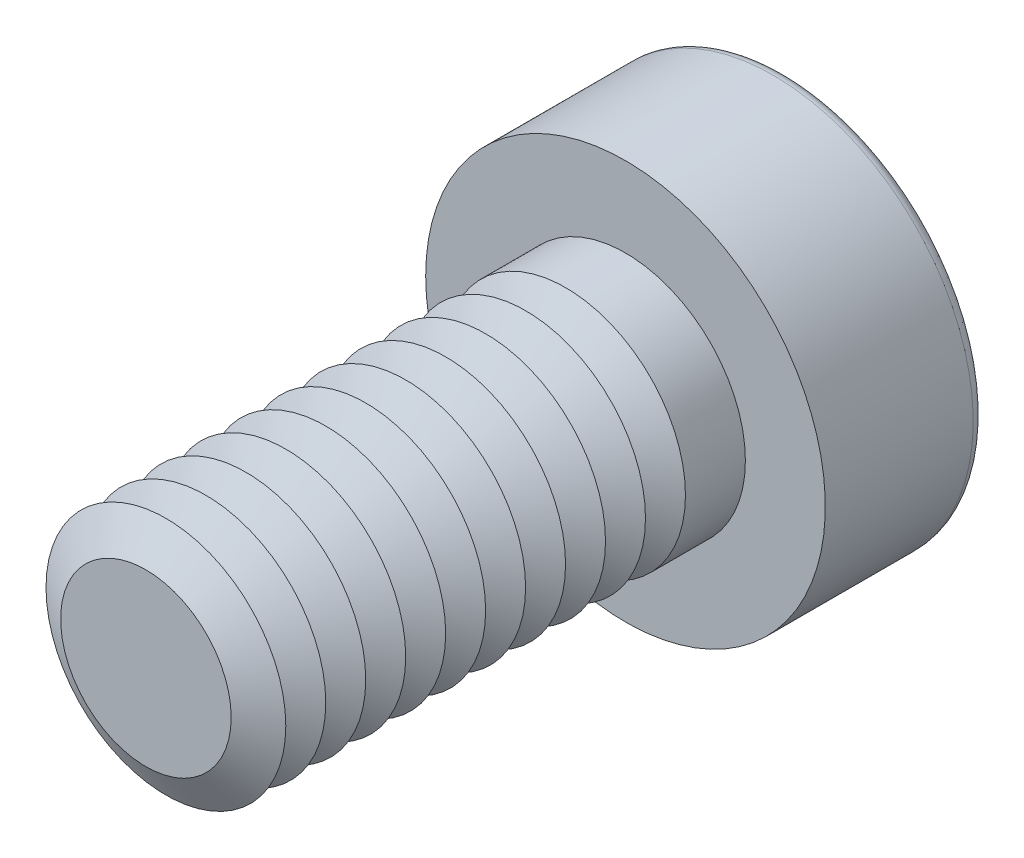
ISO-10303-21;
HEADER;
FILE_DESCRIPTION(('STEP AP214'),'2;1');
FILE_NAME('part.step','',(''),(''),'','','');
FILE_SCHEMA(('AUTOMOTIVE_DESIGN { 1 0 10303 214 1 1 1 1 }'));
ENDSEC;
DATA;
#1=APPLICATION_CONTEXT('core data for automotive mechanical design processes');
#2=APPLICATION_PROTOCOL_DEFINITION('international standard','automotive_design',2000,#1);
#3=PRODUCT_CONTEXT('',#1,'mechanical');
#4=PRODUCT('Part','Part','',(#3));
#5=PRODUCT_RELATED_PRODUCT_CATEGORY('part','',(#4));
#6=PRODUCT_DEFINITION_FORMATION('','',#4);
#7=PRODUCT_DEFINITION_CONTEXT('part definition',#1,'design');
#8=PRODUCT_DEFINITION('design','',#6,#7);
#9=PRODUCT_DEFINITION_SHAPE('','',#8);
#10=(LENGTH_UNIT() NAMED_UNIT(*) SI_UNIT(.MILLI.,.METRE.));
#11=(NAMED_UNIT(*) PLANE_ANGLE_UNIT() SI_UNIT($,.RADIAN.));
#12=(NAMED_UNIT(*) SI_UNIT($,.STERADIAN.) SOLID_ANGLE_UNIT());
#13=UNCERTAINTY_MEASURE_WITH_UNIT(LENGTH_MEASURE(1.E-05),#10,'distance_accuracy_value','');
#14=(GEOMETRIC_REPRESENTATION_CONTEXT(3) GLOBAL_UNCERTAINTY_ASSIGNED_CONTEXT((#13)) GLOBAL_UNIT_ASSIGNED_CONTEXT((#10,
#11,#12)) REPRESENTATION_CONTEXT('',''));
#15=CARTESIAN_POINT('',(0.,0.,0.));
#16=DIRECTION('',(0.,0.,1.));
#17=DIRECTION('',(1.,0.,0.));
#18=AXIS2_PLACEMENT_3D('',#15,#16,#17);
#19=CARTESIAN_POINT('',(0.,0.,8.5));
#20=DIRECTION('',(0.,0.,1.));
#21=DIRECTION('',(1.,0.,0.));
#22=AXIS2_PLACEMENT_3D('',#19,#20,#21);
#23=CONICAL_SURFACE('',#22,3.,1.0471975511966);
#24=CARTESIAN_POINT('',(0.,0.,8.));
#25=DIRECTION('',(0.,0.,1.));
#26=DIRECTION('',(1.,0.,0.));
#27=AXIS2_PLACEMENT_3D('',#24,#25,#26);
#28=CIRCLE('',#27,2.13397459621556);
#29=CARTESIAN_POINT('',(2.13397459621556,0.,8.));
#30=VERTEX_POINT('',#29);
#31=EDGE_CURVE('E313',#30,#30,#28,.T.);
#32=ORIENTED_EDGE('',*,*,#31,.T.);
#33=EDGE_LOOP('',(#32));
#34=FACE_BOUND('',#33,.T.);
#35=CARTESIAN_POINT('',(0.,0.,8.5));
#36=DIRECTION('',(0.,0.,1.));
#37=DIRECTION('',(1.,0.,0.));
#38=AXIS2_PLACEMENT_3D('',#35,#36,#37);
#39=CIRCLE('',#38,3.);
#40=CARTESIAN_POINT('',(3.,0.,8.5));
#41=VERTEX_POINT('',#40);
#42=EDGE_CURVE('E316',#41,#41,#39,.T.);
#43=ORIENTED_EDGE('',*,*,#42,.F.);
#44=EDGE_LOOP('',(#43));
#45=FACE_BOUND('',#44,.T.);
#46=ADVANCED_FACE('F39',(#34,#45),#23,.T.);
#47=CARTESIAN_POINT('',(0.,0.,8.));
#48=DIRECTION('',(0.,0.,-1.));
#49=DIRECTION('',(-1.,0.,0.));
#50=AXIS2_PLACEMENT_3D('',#47,#48,#49);
#51=CONICAL_SURFACE('',#50,2.13397459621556,1.0471975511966);
#52=CARTESIAN_POINT('',(0.,0.,7.5));
#53=DIRECTION('',(0.,0.,1.));
#54=DIRECTION('',(1.,0.,0.));
#55=AXIS2_PLACEMENT_3D('',#52,#53,#54);
#56=CIRCLE('',#55,3.);
#57=CARTESIAN_POINT('',(3.,0.,7.5));
#58=VERTEX_POINT('',#57);
#59=EDGE_CURVE('E324',#58,#58,#56,.T.);
#60=ORIENTED_EDGE('',*,*,#59,.T.);
#61=EDGE_LOOP('',(#60));
#62=FACE_BOUND('',#61,.T.);
#63=ORIENTED_EDGE('',*,*,#31,.F.);
#64=EDGE_LOOP('',(#63));
#65=FACE_BOUND('',#64,.T.);
#66=ADVANCED_FACE('F245',(#62,#65),#51,.T.);
#67=CARTESIAN_POINT('',(0.,0.,12.));
#68=DIRECTION('',(0.,0.,1.));
#69=DIRECTION('',(1.,0.,0.));
#70=AXIS2_PLACEMENT_3D('',#67,#68,#69);
#71=PLANE('',#70);
#72=CARTESIAN_POINT('',(0.,0.,12.));
#73=DIRECTION('',(0.,0.,1.));
#74=DIRECTION('',(1.,0.,0.));
#75=AXIS2_PLACEMENT_3D('',#72,#73,#74);
#76=CIRCLE('',#75,2.13397459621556);
#77=CARTESIAN_POINT('',(2.13397459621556,0.,12.));
#78=VERTEX_POINT('',#77);
#79=EDGE_CURVE('E174',#78,#78,#76,.T.);
#80=ORIENTED_EDGE('',*,*,#79,.T.);
#81=EDGE_LOOP('',(#80));
#82=FACE_BOUND('',#81,.T.);
#83=ADVANCED_FACE('F251',(#82),#71,.T.);
#84=CARTESIAN_POINT('',(0.,0.,12.));
#85=DIRECTION('',(0.,0.,-1.));
#86=DIRECTION('',(-1.,0.,0.));
#87=AXIS2_PLACEMENT_3D('',#84,#85,#86);
#88=CONICAL_SURFACE('',#87,2.13397459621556,1.0471975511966);
#89=CARTESIAN_POINT('',(0.,0.,11.5));
#90=DIRECTION('',(0.,0.,1.));
#91=DIRECTION('',(1.,0.,0.));
#92=AXIS2_PLACEMENT_3D('',#89,#90,#91);
#93=CIRCLE('',#92,3.);
#94=CARTESIAN_POINT('',(3.,0.,11.5));
#95=VERTEX_POINT('',#94);
#96=EDGE_CURVE('E291',#95,#95,#93,.T.);
#97=ORIENTED_EDGE('',*,*,#96,.T.);
#98=EDGE_LOOP('',(#97));
#99=FACE_BOUND('',#98,.T.);
#100=ORIENTED_EDGE('',*,*,#79,.F.);
#101=EDGE_LOOP('',(#100));
#102=FACE_BOUND('',#101,.T.);
#103=ADVANCED_FACE('F199',(#99,#102),#88,.T.);
#104=CARTESIAN_POINT('',(0.,0.,11.5));
#105=DIRECTION('',(0.,0.,1.));
#106=DIRECTION('',(1.,0.,0.));
#107=AXIS2_PLACEMENT_3D('',#104,#105,#106);
#108=CONICAL_SURFACE('',#107,3.,1.0471975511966);
#109=CARTESIAN_POINT('',(0.,0.,11.));
#110=DIRECTION('',(0.,0.,1.));
#111=DIRECTION('',(1.,0.,0.));
#112=AXIS2_PLACEMENT_3D('',#109,#110,#111);
#113=CIRCLE('',#112,2.13397459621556);
#114=CARTESIAN_POINT('',(2.13397459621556,0.,11.));
#115=VERTEX_POINT('',#114);
#116=EDGE_CURVE('E288',#115,#115,#113,.T.);
#117=ORIENTED_EDGE('',*,*,#116,.T.);
#118=EDGE_LOOP('',(#117));
#119=FACE_BOUND('',#118,.T.);
#120=ORIENTED_EDGE('',*,*,#96,.F.);
#121=EDGE_LOOP('',(#120));
#122=FACE_BOUND('',#121,.T.);
#123=ADVANCED_FACE('F277',(#119,#122),#108,.T.);
#124=CARTESIAN_POINT('',(0.,0.,11.));
#125=DIRECTION('',(0.,0.,-1.));
#126=DIRECTION('',(-1.,0.,0.));
#127=AXIS2_PLACEMENT_3D('',#124,#125,#126);
#128=CONICAL_SURFACE('',#127,2.13397459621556,1.0471975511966);
#129=CARTESIAN_POINT('',(0.,0.,10.5));
#130=DIRECTION('',(0.,0.,1.));
#131=DIRECTION('',(1.,0.,0.));
#132=AXIS2_PLACEMENT_3D('',#129,#130,#131);
#133=CIRCLE('',#132,3.);
#134=CARTESIAN_POINT('',(3.,0.,10.5));
#135=VERTEX_POINT('',#134);
#136=EDGE_CURVE('E299',#135,#135,#133,.T.);
#137=ORIENTED_EDGE('',*,*,#136,.T.);
#138=EDGE_LOOP('',(#137));
#139=FACE_BOUND('',#138,.T.);
#140=ORIENTED_EDGE('',*,*,#116,.F.);
#141=EDGE_LOOP('',(#140));
#142=FACE_BOUND('',#141,.T.);
#143=ADVANCED_FACE('F274',(#139,#142),#128,.T.);
#144=CARTESIAN_POINT('',(0.,0.,10.5));
#145=DIRECTION('',(0.,0.,1.));
#146=DIRECTION('',(1.,0.,0.));
#147=AXIS2_PLACEMENT_3D('',#144,#145,#146);
#148=CONICAL_SURFACE('',#147,3.,1.0471975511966);
#149=CARTESIAN_POINT('',(0.,0.,10.));
#150=DIRECTION('',(0.,0.,1.));
#151=DIRECTION('',(1.,0.,0.));
#152=AXIS2_PLACEMENT_3D('',#149,#150,#151);
#153=CIRCLE('',#152,2.13397459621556);
#154=CARTESIAN_POINT('',(2.13397459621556,0.,10.));
#155=VERTEX_POINT('',#154);
#156=EDGE_CURVE('E293',#155,#155,#153,.T.);
#157=ORIENTED_EDGE('',*,*,#156,.T.);
#158=EDGE_LOOP('',(#157));
#159=FACE_BOUND('',#158,.T.);
#160=ORIENTED_EDGE('',*,*,#136,.F.);
#161=EDGE_LOOP('',(#160));
#162=FACE_BOUND('',#161,.T.);
#163=ADVANCED_FACE('F270',(#159,#162),#148,.T.);
#164=CARTESIAN_POINT('',(0.,0.,10.));
#165=DIRECTION('',(0.,0.,-1.));
#166=DIRECTION('',(-1.,0.,0.));
#167=AXIS2_PLACEMENT_3D('',#164,#165,#166);
#168=CONICAL_SURFACE('',#167,2.13397459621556,1.0471975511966);
#169=CARTESIAN_POINT('',(0.,0.,9.5));
#170=DIRECTION('',(0.,0.,1.));
#171=DIRECTION('',(1.,0.,0.));
#172=AXIS2_PLACEMENT_3D('',#169,#170,#171);
#173=CIRCLE('',#172,3.);
#174=CARTESIAN_POINT('',(3.,0.,9.5));
#175=VERTEX_POINT('',#174);
#176=EDGE_CURVE('E309',#175,#175,#173,.T.);
#177=ORIENTED_EDGE('',*,*,#176,.T.);
#178=EDGE_LOOP('',(#177));
#179=FACE_BOUND('',#178,.T.);
#180=ORIENTED_EDGE('',*,*,#156,.F.);
#181=EDGE_LOOP('',(#180));
#182=FACE_BOUND('',#181,.T.);
#183=ADVANCED_FACE('F266',(#179,#182),#168,.T.);
#184=CARTESIAN_POINT('',(0.,0.,9.5));
#185=DIRECTION('',(0.,0.,1.));
#186=DIRECTION('',(1.,0.,0.));
#187=AXIS2_PLACEMENT_3D('',#184,#185,#186);
#188=CONICAL_SURFACE('',#187,3.,1.0471975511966);
#189=CARTESIAN_POINT('',(0.,0.,9.));
#190=DIRECTION('',(0.,0.,1.));
#191=DIRECTION('',(1.,0.,0.));
#192=AXIS2_PLACEMENT_3D('',#189,#190,#191);
#193=CIRCLE('',#192,2.13397459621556);
#194=CARTESIAN_POINT('',(2.13397459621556,0.,9.));
#195=VERTEX_POINT('',#194);
#196=EDGE_CURVE('E305',#195,#195,#193,.T.);
#197=ORIENTED_EDGE('',*,*,#196,.T.);
#198=EDGE_LOOP('',(#197));
#199=FACE_BOUND('',#198,.T.);
#200=ORIENTED_EDGE('',*,*,#176,.F.);
#201=EDGE_LOOP('',(#200));
#202=FACE_BOUND('',#201,.T.);
#203=ADVANCED_FACE('F262',(#199,#202),#188,.T.);
#204=CARTESIAN_POINT('',(0.,0.,9.));
#205=DIRECTION('',(0.,0.,-1.));
#206=DIRECTION('',(-1.,0.,0.));
#207=AXIS2_PLACEMENT_3D('',#204,#205,#206);
#208=CONICAL_SURFACE('',#207,2.13397459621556,1.0471975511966);
#209=ORIENTED_EDGE('',*,*,#42,.T.);
#210=EDGE_LOOP('',(#209));
#211=FACE_BOUND('',#210,.T.);
#212=ORIENTED_EDGE('',*,*,#196,.F.);
#213=EDGE_LOOP('',(#212));
#214=FACE_BOUND('',#213,.T.);
#215=ADVANCED_FACE('F258',(#211,#214),#208,.T.);
#216=CARTESIAN_POINT('',(0.,0.,7.5));
#217=DIRECTION('',(0.,0.,1.));
#218=DIRECTION('',(1.,0.,0.));
#219=AXIS2_PLACEMENT_3D('',#216,#217,#218);
#220=CONICAL_SURFACE('',#219,3.,1.0471975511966);
#221=CARTESIAN_POINT('',(0.,0.,7.));
#222=DIRECTION('',(0.,0.,1.));
#223=DIRECTION('',(1.,0.,0.));
#224=AXIS2_PLACEMENT_3D('',#221,#222,#223);
#225=CIRCLE('',#224,2.13397459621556);
#226=CARTESIAN_POINT('',(2.13397459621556,0.,7.));
#227=VERTEX_POINT('',#226);
#228=EDGE_CURVE('E320',#227,#227,#225,.T.);
#229=ORIENTED_EDGE('',*,*,#228,.T.);
#230=EDGE_LOOP('',(#229));
#231=FACE_BOUND('',#230,.T.);
#232=ORIENTED_EDGE('',*,*,#59,.F.);
#233=EDGE_LOOP('',(#232));
#234=FACE_BOUND('',#233,.T.);
#235=ADVANCED_FACE('F261',(#231,#234),#220,.T.);
#236=CARTESIAN_POINT('',(0.,0.,7.));
#237=DIRECTION('',(0.,0.,-1.));
#238=DIRECTION('',(-1.,0.,0.));
#239=AXIS2_PLACEMENT_3D('',#236,#237,#238);
#240=CONICAL_SURFACE('',#239,2.13397459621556,1.0471975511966);
#241=CARTESIAN_POINT('',(0.,0.,6.5));
#242=DIRECTION('',(0.,0.,1.));
#243=DIRECTION('',(1.,0.,0.));
#244=AXIS2_PLACEMENT_3D('',#241,#242,#243);
#245=CIRCLE('',#244,3.);
#246=CARTESIAN_POINT('',(3.,0.,6.5));
#247=VERTEX_POINT('',#246);
#248=EDGE_CURVE('E332',#247,#247,#245,.T.);
#249=ORIENTED_EDGE('',*,*,#248,.T.);
#250=EDGE_LOOP('',(#249));
#251=FACE_BOUND('',#250,.T.);
#252=ORIENTED_EDGE('',*,*,#228,.F.);
#253=EDGE_LOOP('',(#252));
#254=FACE_BOUND('',#253,.T.);
#255=ADVANCED_FACE('F417',(#251,#254),#240,.T.);
#256=CARTESIAN_POINT('',(0.,0.,6.5));
#257=DIRECTION('',(0.,0.,1.));
#258=DIRECTION('',(1.,0.,0.));
#259=AXIS2_PLACEMENT_3D('',#256,#257,#258);
#260=CONICAL_SURFACE('',#259,3.,1.0471975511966);
#261=CARTESIAN_POINT('',(0.,0.,6.));
#262=DIRECTION('',(0.,0.,1.));
#263=DIRECTION('',(1.,0.,0.));
#264=AXIS2_PLACEMENT_3D('',#261,#262,#263);
#265=CIRCLE('',#264,2.13397459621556);
#266=CARTESIAN_POINT('',(2.13397459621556,0.,6.));
#267=VERTEX_POINT('',#266);
#268=EDGE_CURVE('E328',#267,#267,#265,.T.);
#269=ORIENTED_EDGE('',*,*,#268,.T.);
#270=EDGE_LOOP('',(#269));
#271=FACE_BOUND('',#270,.T.);
#272=ORIENTED_EDGE('',*,*,#248,.F.);
#273=EDGE_LOOP('',(#272));
#274=FACE_BOUND('',#273,.T.);
#275=ADVANCED_FACE('F413',(#271,#274),#260,.T.);
#276=CARTESIAN_POINT('',(0.,0.,6.));
#277=DIRECTION('',(0.,0.,-1.));
#278=DIRECTION('',(-1.,0.,0.));
#279=AXIS2_PLACEMENT_3D('',#276,#277,#278);
#280=CONICAL_SURFACE('',#279,2.13397459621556,1.0471975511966);
#281=CARTESIAN_POINT('',(0.,0.,5.5));
#282=DIRECTION('',(0.,0.,1.));
#283=DIRECTION('',(1.,0.,0.));
#284=AXIS2_PLACEMENT_3D('',#281,#282,#283);
#285=CIRCLE('',#284,3.);
#286=CARTESIAN_POINT('',(3.,0.,5.5));
#287=VERTEX_POINT('',#286);
#288=EDGE_CURVE('E340',#287,#287,#285,.T.);
#289=ORIENTED_EDGE('',*,*,#288,.T.);
#290=EDGE_LOOP('',(#289));
#291=FACE_BOUND('',#290,.T.);
#292=ORIENTED_EDGE('',*,*,#268,.F.);
#293=EDGE_LOOP('',(#292));
#294=FACE_BOUND('',#293,.T.);
#295=ADVANCED_FACE('F409',(#291,#294),#280,.T.);
#296=CARTESIAN_POINT('',(0.,0.,5.5));
#297=DIRECTION('',(0.,0.,1.));
#298=DIRECTION('',(1.,0.,0.));
#299=AXIS2_PLACEMENT_3D('',#296,#297,#298);
#300=CONICAL_SURFACE('',#299,3.,1.0471975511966);
#301=CARTESIAN_POINT('',(0.,0.,5.));
#302=DIRECTION('',(0.,0.,1.));
#303=DIRECTION('',(1.,0.,0.));
#304=AXIS2_PLACEMENT_3D('',#301,#302,#303);
#305=CIRCLE('',#304,2.13397459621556);
#306=CARTESIAN_POINT('',(2.13397459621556,0.,5.));
#307=VERTEX_POINT('',#306);
#308=EDGE_CURVE('E336',#307,#307,#305,.T.);
#309=ORIENTED_EDGE('',*,*,#308,.T.);
#310=EDGE_LOOP('',(#309));
#311=FACE_BOUND('',#310,.T.);
#312=ORIENTED_EDGE('',*,*,#288,.F.);
#313=EDGE_LOOP('',(#312));
#314=FACE_BOUND('',#313,.T.);
#315=ADVANCED_FACE('F405',(#311,#314),#300,.T.);
#316=CARTESIAN_POINT('',(0.,0.,5.));
#317=DIRECTION('',(0.,0.,-1.));
#318=DIRECTION('',(-1.,0.,0.));
#319=AXIS2_PLACEMENT_3D('',#316,#317,#318);
#320=CONICAL_SURFACE('',#319,2.13397459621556,1.0471975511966);
#321=CARTESIAN_POINT('',(0.,0.,4.5));
#322=DIRECTION('',(0.,0.,1.));
#323=DIRECTION('',(1.,0.,0.));
#324=AXIS2_PLACEMENT_3D('',#321,#322,#323);
#325=CIRCLE('',#324,3.);
#326=CARTESIAN_POINT('',(3.,0.,4.5));
#327=VERTEX_POINT('',#326);
#328=EDGE_CURVE('E348',#327,#327,#325,.T.);
#329=ORIENTED_EDGE('',*,*,#328,.T.);
#330=EDGE_LOOP('',(#329));
#331=FACE_BOUND('',#330,.T.);
#332=ORIENTED_EDGE('',*,*,#308,.F.);
#333=EDGE_LOOP('',(#332));
#334=FACE_BOUND('',#333,.T.);
#335=ADVANCED_FACE('F401',(#331,#334),#320,.T.);
#336=CARTESIAN_POINT('',(0.,0.,4.5));
#337=DIRECTION('',(0.,0.,1.));
#338=DIRECTION('',(1.,0.,0.));
#339=AXIS2_PLACEMENT_3D('',#336,#337,#338);
#340=CONICAL_SURFACE('',#339,3.,1.0471975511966);
#341=CARTESIAN_POINT('',(0.,0.,4.));
#342=DIRECTION('',(0.,0.,1.));
#343=DIRECTION('',(1.,0.,0.));
#344=AXIS2_PLACEMENT_3D('',#341,#342,#343);
#345=CIRCLE('',#344,2.13397459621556);
#346=CARTESIAN_POINT('',(2.13397459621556,0.,4.));
#347=VERTEX_POINT('',#346);
#348=EDGE_CURVE('E344',#347,#347,#345,.T.);
#349=ORIENTED_EDGE('',*,*,#348,.T.);
#350=EDGE_LOOP('',(#349));
#351=FACE_BOUND('',#350,.T.);
#352=ORIENTED_EDGE('',*,*,#328,.F.);
#353=EDGE_LOOP('',(#352));
#354=FACE_BOUND('',#353,.T.);
#355=ADVANCED_FACE('F397',(#351,#354),#340,.T.);
#356=CARTESIAN_POINT('',(0.,0.,4.));
#357=DIRECTION('',(0.,0.,-1.));
#358=DIRECTION('',(-1.,0.,0.));
#359=AXIS2_PLACEMENT_3D('',#356,#357,#358);
#360=CONICAL_SURFACE('',#359,2.13397459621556,1.0471975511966);
#361=CARTESIAN_POINT('',(0.,0.,3.5));
#362=DIRECTION('',(0.,0.,1.));
#363=DIRECTION('',(1.,0.,0.));
#364=AXIS2_PLACEMENT_3D('',#361,#362,#363);
#365=CIRCLE('',#364,3.);
#366=CARTESIAN_POINT('',(3.,0.,3.5));
#367=VERTEX_POINT('',#366);
#368=EDGE_CURVE('E356',#367,#367,#365,.T.);
#369=ORIENTED_EDGE('',*,*,#368,.T.);
#370=EDGE_LOOP('',(#369));
#371=FACE_BOUND('',#370,.T.);
#372=ORIENTED_EDGE('',*,*,#348,.F.);
#373=EDGE_LOOP('',(#372));
#374=FACE_BOUND('',#373,.T.);
#375=ADVANCED_FACE('F393',(#371,#374),#360,.T.);
#376=CARTESIAN_POINT('',(0.,0.,3.5));
#377=DIRECTION('',(0.,0.,1.));
#378=DIRECTION('',(1.,0.,0.));
#379=AXIS2_PLACEMENT_3D('',#376,#377,#378);
#380=CONICAL_SURFACE('',#379,3.,1.0471975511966);
#381=CARTESIAN_POINT('',(0.,0.,3.));
#382=DIRECTION('',(0.,0.,1.));
#383=DIRECTION('',(1.,0.,0.));
#384=AXIS2_PLACEMENT_3D('',#381,#382,#383);
#385=CIRCLE('',#384,2.13397459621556);
#386=CARTESIAN_POINT('',(2.13397459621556,0.,3.));
#387=VERTEX_POINT('',#386);
#388=EDGE_CURVE('E352',#387,#387,#385,.T.);
#389=ORIENTED_EDGE('',*,*,#388,.T.);
#390=EDGE_LOOP('',(#389));
#391=FACE_BOUND('',#390,.T.);
#392=ORIENTED_EDGE('',*,*,#368,.F.);
#393=EDGE_LOOP('',(#392));
#394=FACE_BOUND('',#393,.T.);
#395=ADVANCED_FACE('F388',(#391,#394),#380,.T.);
#396=CARTESIAN_POINT('',(0.,0.,3.));
#397=DIRECTION('',(0.,0.,-1.));
#398=DIRECTION('',(-1.,0.,0.));
#399=AXIS2_PLACEMENT_3D('',#396,#397,#398);
#400=CONICAL_SURFACE('',#399,2.13397459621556,1.0471975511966);
#401=CARTESIAN_POINT('',(0.,0.,2.5));
#402=DIRECTION('',(0.,0.,1.));
#403=DIRECTION('',(1.,0.,0.));
#404=AXIS2_PLACEMENT_3D('',#401,#402,#403);
#405=CIRCLE('',#404,3.);
#406=CARTESIAN_POINT('',(3.,0.,2.5));
#407=VERTEX_POINT('',#406);
#408=EDGE_CURVE('E368',#407,#407,#405,.T.);
#409=ORIENTED_EDGE('',*,*,#408,.T.);
#410=EDGE_LOOP('',(#409));
#411=FACE_BOUND('',#410,.T.);
#412=ORIENTED_EDGE('',*,*,#388,.F.);
#413=EDGE_LOOP('',(#412));
#414=FACE_BOUND('',#413,.T.);
#415=ADVANCED_FACE('F374',(#411,#414),#400,.T.);
#416=CARTESIAN_POINT('',(0.,0.,2.5));
#417=DIRECTION('',(0.,0.,1.));
#418=DIRECTION('',(1.,0.,0.));
#419=AXIS2_PLACEMENT_3D('',#416,#417,#418);
#420=CONICAL_SURFACE('',#419,3.,1.0471975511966);
#421=CARTESIAN_POINT('',(0.,0.,2.));
#422=DIRECTION('',(0.,0.,1.));
#423=DIRECTION('',(1.,0.,0.));
#424=AXIS2_PLACEMENT_3D('',#421,#422,#423);
#425=CIRCLE('',#424,2.13397459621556);
#426=CARTESIAN_POINT('',(2.13397459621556,0.,2.));
#427=VERTEX_POINT('',#426);
#428=EDGE_CURVE('E360',#427,#427,#425,.T.);
#429=ORIENTED_EDGE('',*,*,#428,.T.);
#430=EDGE_LOOP('',(#429));
#431=FACE_BOUND('',#430,.T.);
#432=ORIENTED_EDGE('',*,*,#408,.F.);
#433=EDGE_LOOP('',(#432));
#434=FACE_BOUND('',#433,.T.);
#435=ADVANCED_FACE('F377',(#431,#434),#420,.T.);
#436=CARTESIAN_POINT('',(0.,0.,2.));
#437=DIRECTION('',(0.,0.,-1.));
#438=DIRECTION('',(-1.,0.,0.));
#439=AXIS2_PLACEMENT_3D('',#436,#437,#438);
#440=CONICAL_SURFACE('',#439,2.13397459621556,1.0471975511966);
#441=CARTESIAN_POINT('',(0.,0.,1.5));
#442=DIRECTION('',(0.,0.,1.));
#443=DIRECTION('',(1.,0.,0.));
#444=AXIS2_PLACEMENT_3D('',#441,#442,#443);
#445=CIRCLE('',#444,3.);
#446=CARTESIAN_POINT('',(3.,0.,1.5));
#447=VERTEX_POINT('',#446);
#448=EDGE_CURVE('E364',#447,#447,#445,.T.);
#449=ORIENTED_EDGE('',*,*,#448,.T.);
#450=EDGE_LOOP('',(#449));
#451=FACE_BOUND('',#450,.T.);
#452=ORIENTED_EDGE('',*,*,#428,.F.);
#453=EDGE_LOOP('',(#452));
#454=FACE_BOUND('',#453,.T.);
#455=ADVANCED_FACE('F379',(#451,#454),#440,.T.);
#456=CARTESIAN_POINT('',(0.,0.,-1.));
#457=DIRECTION('',(0.,0.,-1.));
#458=DIRECTION('',(-1.,0.,0.));
#459=AXIS2_PLACEMENT_3D('',#456,#457,#458);
#460=CONICAL_SURFACE('',#459,2.,1.0471975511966);
#461=CARTESIAN_POINT('',(0.,0.,0.154700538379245));
#462=VERTEX_POINT('',#461);
#463=VERTEX_LOOP('',#462);
#464=FACE_BOUND('',#463,.T.);
#465=CARTESIAN_POINT('',(0.,0.,-1.));
#466=DIRECTION('',(0.,0.,-1.));
#467=DIRECTION('',(-1.,0.,0.));
#468=AXIS2_PLACEMENT_3D('',#465,#466,#467);
#469=CIRCLE('',#468,2.);
#470=CARTESIAN_POINT('',(-1.73205080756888,0.999999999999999,-1.));
#471=VERTEX_POINT('',#470);
#472=CARTESIAN_POINT('',(0.,2.,-1.));
#473=VERTEX_POINT('',#472);
#474=EDGE_CURVE('E149',#471,#473,#469,.T.);
#475=ORIENTED_EDGE('',*,*,#474,.T.);
#476=CARTESIAN_POINT('',(0.,0.,-1.));
#477=DIRECTION('',(0.,0.,-1.));
#478=DIRECTION('',(-1.,0.,0.));
#479=AXIS2_PLACEMENT_3D('',#476,#477,#478);
#480=CIRCLE('',#479,2.);
#481=CARTESIAN_POINT('',(1.73205080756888,1.,-1.));
#482=VERTEX_POINT('',#481);
#483=EDGE_CURVE('E54',#473,#482,#480,.T.);
#484=ORIENTED_EDGE('',*,*,#483,.T.);
#485=CARTESIAN_POINT('',(1.73205080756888,-0.999999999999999,-1.));
#486=VERTEX_POINT('',#485);
#487=EDGE_CURVE('E847',#482,#486,#480,.T.);
#488=ORIENTED_EDGE('',*,*,#487,.T.);
#489=CARTESIAN_POINT('',(0.,-2.,-1.));
#490=VERTEX_POINT('',#489);
#491=EDGE_CURVE('E845',#486,#490,#480,.T.);
#492=ORIENTED_EDGE('',*,*,#491,.T.);
#493=CARTESIAN_POINT('',(-1.73205080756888,-0.999999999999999,-1.));
#494=VERTEX_POINT('',#493);
#495=EDGE_CURVE('E840',#490,#494,#480,.T.);
#496=ORIENTED_EDGE('',*,*,#495,.T.);
#497=EDGE_CURVE('E838',#494,#471,#480,.T.);
#498=ORIENTED_EDGE('',*,*,#497,.T.);
#499=EDGE_LOOP('',(#475,#484,#488,#492,#496,#498));
#500=FACE_BOUND('',#499,.T.);
#501=ADVANCED_FACE('F201',(#464,#500),#460,.F.);
#502=CARTESIAN_POINT('',(0.,0.,-1.));
#503=DIRECTION('',(0.,0.,-1.));
#504=DIRECTION('',(-1.,0.,0.));
#505=AXIS2_PLACEMENT_3D('',#502,#503,#504);
#506=PLANE('',#505);
#507=ORIENTED_EDGE('',*,*,#483,.F.);
#508=DIRECTION('',(1.,0.,0.));
#509=VECTOR('',#508,1.);
#510=CARTESIAN_POINT('',(-1.15470053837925,2.,-1.));
#511=LINE('',#510,#509);
#512=CARTESIAN_POINT('',(1.15470053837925,2.,-1.));
#513=VERTEX_POINT('',#512);
#514=EDGE_CURVE('E886',#473,#513,#511,.T.);
#515=ORIENTED_EDGE('',*,*,#514,.T.);
#516=DIRECTION('',(0.5,-0.866025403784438,0.));
#517=VECTOR('',#516,1.);
#518=CARTESIAN_POINT('',(1.15470053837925,2.,-1.));
#519=LINE('',#518,#517);
#520=EDGE_CURVE('E155',#513,#482,#519,.T.);
#521=ORIENTED_EDGE('',*,*,#520,.T.);
#522=EDGE_LOOP('',(#507,#515,#521));
#523=FACE_BOUND('',#522,.T.);
#524=ADVANCED_FACE('F476',(#523),#506,.T.);
#525=ORIENTED_EDGE('',*,*,#487,.F.);
#526=CARTESIAN_POINT('',(2.3094010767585,0.,-1.));
#527=VERTEX_POINT('',#526);
#528=EDGE_CURVE('E889',#482,#527,#519,.T.);
#529=ORIENTED_EDGE('',*,*,#528,.T.);
#530=DIRECTION('',(-0.5,-0.866025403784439,0.));
#531=VECTOR('',#530,1.);
#532=CARTESIAN_POINT('',(2.3094010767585,0.,-1.));
#533=LINE('',#532,#531);
#534=EDGE_CURVE('E863',#527,#486,#533,.T.);
#535=ORIENTED_EDGE('',*,*,#534,.T.);
#536=EDGE_LOOP('',(#525,#529,#535));
#537=FACE_BOUND('',#536,.T.);
#538=ADVANCED_FACE('F486',(#537),#506,.T.);
#539=ORIENTED_EDGE('',*,*,#491,.F.);
#540=CARTESIAN_POINT('',(1.15470053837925,-2.,-1.));
#541=VERTEX_POINT('',#540);
#542=EDGE_CURVE('E865',#486,#541,#533,.T.);
#543=ORIENTED_EDGE('',*,*,#542,.T.);
#544=DIRECTION('',(-1.,0.,0.));
#545=VECTOR('',#544,1.);
#546=CARTESIAN_POINT('',(1.15470053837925,-2.,-1.));
#547=LINE('',#546,#545);
#548=EDGE_CURVE('E813',#541,#490,#547,.T.);
#549=ORIENTED_EDGE('',*,*,#548,.T.);
#550=EDGE_LOOP('',(#539,#543,#549));
#551=FACE_BOUND('',#550,.T.);
#552=ADVANCED_FACE('F496',(#551),#506,.T.);
#553=ORIENTED_EDGE('',*,*,#495,.F.);
#554=CARTESIAN_POINT('',(-1.15470053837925,-2.,-1.));
#555=VERTEX_POINT('',#554);
#556=EDGE_CURVE('E859',#490,#555,#547,.T.);
#557=ORIENTED_EDGE('',*,*,#556,.T.);
#558=DIRECTION('',(-0.5,0.866025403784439,0.));
#559=VECTOR('',#558,1.);
#560=CARTESIAN_POINT('',(-1.15470053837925,-2.,-1.));
#561=LINE('',#560,#559);
#562=EDGE_CURVE('E861',#555,#494,#561,.T.);
#563=ORIENTED_EDGE('',*,*,#562,.T.);
#564=EDGE_LOOP('',(#553,#557,#563));
#565=FACE_BOUND('',#564,.T.);
#566=ADVANCED_FACE('F504',(#565),#506,.T.);
#567=ORIENTED_EDGE('',*,*,#497,.F.);
#568=CARTESIAN_POINT('',(-2.3094010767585,0.,-1.));
#569=VERTEX_POINT('',#568);
#570=EDGE_CURVE('E867',#494,#569,#561,.T.);
#571=ORIENTED_EDGE('',*,*,#570,.T.);
#572=DIRECTION('',(0.5,0.866025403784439,0.));
#573=VECTOR('',#572,1.);
#574=CARTESIAN_POINT('',(-2.3094010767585,0.,-1.));
#575=LINE('',#574,#573);
#576=EDGE_CURVE('E158',#569,#471,#575,.T.);
#577=ORIENTED_EDGE('',*,*,#576,.T.);
#578=EDGE_LOOP('',(#567,#571,#577));
#579=FACE_BOUND('',#578,.T.);
#580=ADVANCED_FACE('F231',(#579),#506,.T.);
#581=ORIENTED_EDGE('',*,*,#474,.F.);
#582=CARTESIAN_POINT('',(-1.15470053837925,2.,-1.));
#583=VERTEX_POINT('',#582);
#584=EDGE_CURVE('E873',#471,#583,#575,.T.);
#585=ORIENTED_EDGE('',*,*,#584,.T.);
#586=EDGE_CURVE('E884',#583,#473,#511,.T.);
#587=ORIENTED_EDGE('',*,*,#586,.T.);
#588=EDGE_LOOP('',(#581,#585,#587));
#589=FACE_BOUND('',#588,.T.);
#590=ADVANCED_FACE('F488',(#589),#506,.T.);
#591=CARTESIAN_POINT('',(-1.15470053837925,2.,-1.));
#592=DIRECTION('',(0.,1.,0.));
#593=DIRECTION('',(0.,0.,1.));
#594=AXIS2_PLACEMENT_3D('',#591,#592,#593);
#595=PLANE('',#594);
#596=DIRECTION('',(0.,0.,-1.));
#597=VECTOR('',#596,1.);
#598=CARTESIAN_POINT('',(-1.15470053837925,2.,-1.));
#599=LINE('',#598,#597);
#600=CARTESIAN_POINT('',(-1.15470053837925,2.,-4.));
#601=VERTEX_POINT('',#600);
#602=EDGE_CURVE('E147',#583,#601,#599,.T.);
#603=ORIENTED_EDGE('',*,*,#602,.T.);
#604=CARTESIAN_POINT('',(-3.01440758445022,2.,-4.35051689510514));
#605=CARTESIAN_POINT('',(-2.92409762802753,2.,-4.33035636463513));
#606=CARTESIAN_POINT('',(-2.83373054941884,2.,-4.31045254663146));
#607=CARTESIAN_POINT('',(-2.65285291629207,2.,-4.27128852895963));
#608=CARTESIAN_POINT('',(-2.562342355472,2.,-4.25202835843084));
#609=CARTESIAN_POINT('',(-2.29037985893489,2.,-4.19537300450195));
#610=CARTESIAN_POINT('',(-2.10868043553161,2.,-4.15914446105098));
#611=CARTESIAN_POINT('',(-1.74597297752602,2.,-4.09171688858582));
#612=CARTESIAN_POINT('',(-1.56497266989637,2.,-4.06047686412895));
#613=CARTESIAN_POINT('',(-1.20186568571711,2.,-4.00513826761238));
#614=CARTESIAN_POINT('',(-1.01975924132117,2.,-3.98103824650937));
#615=CARTESIAN_POINT('',(-0.744747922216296,2.,-3.9525901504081));
#616=CARTESIAN_POINT('',(-0.652245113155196,2.,-3.9443671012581));
#617=CARTESIAN_POINT('',(-0.467020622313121,2.,-3.93099406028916));
#618=CARTESIAN_POINT('',(-0.374298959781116,2.,-3.92584380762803));
#619=CARTESIAN_POINT('',(-0.188764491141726,2.,-3.91891540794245));
#620=CARTESIAN_POINT('',(-0.0959517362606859,2.,-3.91713591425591));
#621=CARTESIAN_POINT('',(0.0896753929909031,2.,-3.91705786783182));
#622=CARTESIAN_POINT('',(0.182489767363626,2.,-3.91875932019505));
#623=CARTESIAN_POINT('',(0.368369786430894,2.,-3.92554892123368));
#624=CARTESIAN_POINT('',(0.461434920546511,2.,-3.93065079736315));
#625=CARTESIAN_POINT('',(0.647346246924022,2.,-3.94395663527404));
#626=CARTESIAN_POINT('',(0.740192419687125,2.,-3.95216086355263));
#627=CARTESIAN_POINT('',(1.01841374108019,2.,-3.98081777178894));
#628=CARTESIAN_POINT('',(1.2033713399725,2.,-4.00531018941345));
#629=CARTESIAN_POINT('',(1.57694396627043,2.,-4.06236202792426));
#630=CARTESIAN_POINT('',(1.76552771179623,2.,-4.09511615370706));
#631=CARTESIAN_POINT('',(2.14178491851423,2.,-4.1655706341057));
#632=CARTESIAN_POINT('',(2.32945822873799,2.,-4.20327178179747));
#633=CARTESIAN_POINT('',(2.70417911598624,2.,-4.28188312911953));
#634=CARTESIAN_POINT('',(2.89122649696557,2.,-4.32279425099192));
#635=CARTESIAN_POINT('',(3.26484478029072,2.,-4.40674298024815));
#636=CARTESIAN_POINT('',(3.45141567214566,2.,-4.44978063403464));
#637=CARTESIAN_POINT('',(3.821938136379,2.,-4.53678178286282));
#638=CARTESIAN_POINT('',(4.00589388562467,2.,-4.58072756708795));
#639=CARTESIAN_POINT('',(4.37356350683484,2.,-4.66963526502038));
#640=CARTESIAN_POINT('',(4.55727737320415,2.,-4.71459720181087));
#641=CARTESIAN_POINT('',(4.9242660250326,2.,-4.80519833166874));
#642=CARTESIAN_POINT('',(5.10754106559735,2.,-4.85083649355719));
#643=CARTESIAN_POINT('',(5.47394280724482,2.,-4.94267693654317));
#644=CARTESIAN_POINT('',(5.65706951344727,2.,-4.98887919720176));
#645=CARTESIAN_POINT('',(5.84014583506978,2.,-5.03527803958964));
#646=B_SPLINE_CURVE_WITH_KNOTS('',3,(#604,#605,#606,#607,#608,#609,#610,#611,#612,#613,#614,
#615,#616,#617,#618,#619,#620,#621,#622,#623,#624,#625,#626,#627,#628,#629,#630,#631,#632,#633,
#634,#635,#636,#637,#638,#639,#640,#641,#642,#643,#644,#645),.UNSPECIFIED.,.F.,.F.,(4,2,2,2,2,2,
2,2,2,2,2,2,2,2,2,2,2,2,2,2,4),(0.,0.277597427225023,0.555207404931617,1.11099118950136,
1.66194208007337,2.21278108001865,2.49134108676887,2.76987744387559,3.04830249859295,
3.32672796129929,3.60628428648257,3.88586463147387,4.44532615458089,5.0194589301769,
5.59368385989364,6.16807437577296,6.74247743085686,7.30986991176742,7.87727529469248,
8.44388991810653,9.01048407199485),.UNSPECIFIED.);
#647=CARTESIAN_POINT('',(1.15470053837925,2.,-4.));
#648=VERTEX_POINT('',#647);
#649=EDGE_CURVE('E124',#601,#648,#646,.T.);
#650=ORIENTED_EDGE('',*,*,#649,.T.);
#651=DIRECTION('',(0.,0.,-1.));
#652=VECTOR('',#651,1.);
#653=CARTESIAN_POINT('',(1.15470053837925,2.,-1.));
#654=LINE('',#653,#652);
#655=EDGE_CURVE('E143',#513,#648,#654,.T.);
#656=ORIENTED_EDGE('',*,*,#655,.F.);
#657=ORIENTED_EDGE('',*,*,#514,.F.);
#658=ORIENTED_EDGE('',*,*,#586,.F.);
#659=EDGE_LOOP('',(#603,#650,#656,#657,#658));
#660=FACE_BOUND('',#659,.T.);
#661=ADVANCED_FACE('F141',(#660),#595,.F.);
#662=CARTESIAN_POINT('',(1.15470053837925,2.,-1.));
#663=DIRECTION('',(0.866025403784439,0.5,0.));
#664=DIRECTION('',(-0.5,0.866025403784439,0.));
#665=AXIS2_PLACEMENT_3D('',#662,#663,#664);
#666=PLANE('',#665);
#667=ORIENTED_EDGE('',*,*,#655,.T.);
#668=CARTESIAN_POINT('',(1.15458506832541,2.0002,-4.00003094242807));
#669=CARTESIAN_POINT('',(1.20254643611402,1.91712847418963,-3.98717294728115));
#670=CARTESIAN_POINT('',(1.25059477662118,1.83390630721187,-3.97549990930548));
#671=CARTESIAN_POINT('',(1.3468611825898,1.66716800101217,-3.95499135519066));
#672=CARTESIAN_POINT('',(1.39507930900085,1.58365175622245,-3.94615699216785));
#673=CARTESIAN_POINT('',(1.49139287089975,1.41683177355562,-3.93184164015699));
#674=CARTESIAN_POINT('',(1.53948765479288,1.33352916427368,-3.92634357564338));
#675=CARTESIAN_POINT('',(1.63573857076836,1.1668176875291,-3.91897122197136));
#676=CARTESIAN_POINT('',(1.68389468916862,1.08340884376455,-3.91709623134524));
#677=CARTESIAN_POINT('',(1.78020692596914,0.916591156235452,-3.91709623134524));
#678=CARTESIAN_POINT('',(1.82836304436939,0.833182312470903,-3.91897122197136));
#679=CARTESIAN_POINT('',(1.92461396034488,0.666470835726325,-3.92634357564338));
#680=CARTESIAN_POINT('',(1.972708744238,0.583168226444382,-3.93184164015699));
#681=CARTESIAN_POINT('',(2.06902230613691,0.416348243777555,-3.94615699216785));
#682=CARTESIAN_POINT('',(2.11724043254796,0.332831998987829,-3.95499135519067));
#683=CARTESIAN_POINT('',(2.21350683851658,0.16609369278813,-3.97549990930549));
#684=CARTESIAN_POINT('',(2.26155517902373,0.0828715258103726,-3.98717294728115));
#685=CARTESIAN_POINT('',(2.30951654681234,-0.000199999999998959,-4.00003094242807));
#686=B_SPLINE_CURVE_WITH_KNOTS('',3,(#668,#669,#670,#671,#672,#673,#674,#675,#676,#677,#678,
#679,#680,#681,#682,#683,#684,#685),.UNSPECIFIED.,.F.,.F.,(4,2,2,2,2,2,2,2,4),(0.,
0.29035724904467,0.580832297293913,0.869807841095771,1.15872743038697,1.44764701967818,
1.73662256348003,2.02709761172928,2.31745486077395),.UNSPECIFIED.);
#687=CARTESIAN_POINT('',(2.3094010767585,0.,-4.));
#688=VERTEX_POINT('',#687);
#689=EDGE_CURVE('E11',#648,#688,#686,.T.);
#690=ORIENTED_EDGE('',*,*,#689,.T.);
#691=DIRECTION('',(0.,0.,-1.));
#692=VECTOR('',#691,1.);
#693=CARTESIAN_POINT('',(2.3094010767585,0.,-1.));
#694=LINE('',#693,#692);
#695=EDGE_CURVE('E157',#527,#688,#694,.T.);
#696=ORIENTED_EDGE('',*,*,#695,.F.);
#697=ORIENTED_EDGE('',*,*,#528,.F.);
#698=ORIENTED_EDGE('',*,*,#520,.F.);
#699=EDGE_LOOP('',(#667,#690,#696,#697,#698));
#700=FACE_BOUND('',#699,.T.);
#701=ADVANCED_FACE('F152',(#700),#666,.F.);
#702=CARTESIAN_POINT('',(2.3094010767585,0.,-1.));
#703=DIRECTION('',(0.866025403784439,-0.5,0.));
#704=DIRECTION('',(0.5,0.866025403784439,0.));
#705=AXIS2_PLACEMENT_3D('',#702,#703,#704);
#706=PLANE('',#705);
#707=ORIENTED_EDGE('',*,*,#695,.T.);
#708=CARTESIAN_POINT('',(2.30951654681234,0.000200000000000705,-4.00003094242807));
#709=CARTESIAN_POINT('',(2.26155517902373,-0.0828715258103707,-3.98717294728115));
#710=CARTESIAN_POINT('',(2.21350683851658,-0.166093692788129,-3.97549990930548));
#711=CARTESIAN_POINT('',(2.11724043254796,-0.332831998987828,-3.95499135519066));
#712=CARTESIAN_POINT('',(2.06902230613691,-0.416348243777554,-3.94615699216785));
#713=CARTESIAN_POINT('',(1.972708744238,-0.583168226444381,-3.93184164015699));
#714=CARTESIAN_POINT('',(1.92461396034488,-0.666470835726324,-3.92634357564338));
#715=CARTESIAN_POINT('',(1.82836304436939,-0.833182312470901,-3.91897122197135));
#716=CARTESIAN_POINT('',(1.78020692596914,-0.91659115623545,-3.91709623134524));
#717=CARTESIAN_POINT('',(1.68389468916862,-1.08340884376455,-3.91709623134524));
#718=CARTESIAN_POINT('',(1.63573857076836,-1.1668176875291,-3.91897122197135));
#719=CARTESIAN_POINT('',(1.53948765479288,-1.33352916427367,-3.92634357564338));
#720=CARTESIAN_POINT('',(1.49139287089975,-1.41683177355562,-3.93184164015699));
#721=CARTESIAN_POINT('',(1.39507930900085,-1.58365175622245,-3.94615699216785));
#722=CARTESIAN_POINT('',(1.3468611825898,-1.66716800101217,-3.95499135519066));
#723=CARTESIAN_POINT('',(1.25059477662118,-1.83390630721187,-3.97549990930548));
#724=CARTESIAN_POINT('',(1.20254643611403,-1.91712847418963,-3.98717294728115));
#725=CARTESIAN_POINT('',(1.15458506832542,-2.0002,-4.00003094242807));
#726=B_SPLINE_CURVE_WITH_KNOTS('',3,(#708,#709,#710,#711,#712,#713,#714,#715,#716,#717,#718,
#719,#720,#721,#722,#723,#724,#725),.UNSPECIFIED.,.F.,.F.,(4,2,2,2,2,2,2,2,4),(0.,
0.290357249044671,0.580832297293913,0.869807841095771,1.15872743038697,1.44764701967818,
1.73662256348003,2.02709761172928,2.31745486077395),.UNSPECIFIED.);
#727=CARTESIAN_POINT('',(1.15470053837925,-2.,-4.));
#728=VERTEX_POINT('',#727);
#729=EDGE_CURVE('E173',#688,#728,#726,.T.);
#730=ORIENTED_EDGE('',*,*,#729,.T.);
#731=DIRECTION('',(0.,0.,-1.));
#732=VECTOR('',#731,1.);
#733=CARTESIAN_POINT('',(1.15470053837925,-2.,-1.));
#734=LINE('',#733,#732);
#735=EDGE_CURVE('E808',#541,#728,#734,.T.);
#736=ORIENTED_EDGE('',*,*,#735,.F.);
#737=ORIENTED_EDGE('',*,*,#542,.F.);
#738=ORIENTED_EDGE('',*,*,#534,.F.);
#739=EDGE_LOOP('',(#707,#730,#736,#737,#738));
#740=FACE_BOUND('',#739,.T.);
#741=ADVANCED_FACE('F191',(#740),#706,.F.);
#742=CARTESIAN_POINT('',(1.15470053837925,-2.,-1.));
#743=DIRECTION('',(0.,-1.,0.));
#744=DIRECTION('',(0.,0.,-1.));
#745=AXIS2_PLACEMENT_3D('',#742,#743,#744);
#746=PLANE('',#745);
#747=ORIENTED_EDGE('',*,*,#735,.T.);
#748=CARTESIAN_POINT('',(-3.01440758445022,-2.,-4.35051689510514));
#749=CARTESIAN_POINT('',(-2.92409762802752,-2.,-4.33035636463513));
#750=CARTESIAN_POINT('',(-2.83373054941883,-2.,-4.31045254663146));
#751=CARTESIAN_POINT('',(-2.65285291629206,-2.,-4.27128852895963));
#752=CARTESIAN_POINT('',(-2.562342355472,-2.,-4.25202835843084));
#753=CARTESIAN_POINT('',(-2.29037985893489,-2.,-4.19537300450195));
#754=CARTESIAN_POINT('',(-2.10868043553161,-2.,-4.15914446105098));
#755=CARTESIAN_POINT('',(-1.74597297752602,-2.,-4.09171688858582));
#756=CARTESIAN_POINT('',(-1.56497266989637,-2.,-4.06047686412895));
#757=CARTESIAN_POINT('',(-1.20186568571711,-2.,-4.00513826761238));
#758=CARTESIAN_POINT('',(-1.01975924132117,-2.,-3.98103824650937));
#759=CARTESIAN_POINT('',(-0.744747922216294,-2.,-3.9525901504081));
#760=CARTESIAN_POINT('',(-0.652245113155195,-2.,-3.9443671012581));
#761=CARTESIAN_POINT('',(-0.46702062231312,-2.,-3.93099406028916));
#762=CARTESIAN_POINT('',(-0.374298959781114,-2.,-3.92584380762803));
#763=CARTESIAN_POINT('',(-0.188764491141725,-2.,-3.91891540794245));
#764=CARTESIAN_POINT('',(-0.0959517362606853,-2.,-3.91713591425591));
#765=CARTESIAN_POINT('',(0.0896753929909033,-2.,-3.91705786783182));
#766=CARTESIAN_POINT('',(0.182489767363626,-2.,-3.91875932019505));
#767=CARTESIAN_POINT('',(0.368369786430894,-2.,-3.92554892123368));
#768=CARTESIAN_POINT('',(0.461434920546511,-2.,-3.93065079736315));
#769=CARTESIAN_POINT('',(0.647346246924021,-2.,-3.94395663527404));
#770=CARTESIAN_POINT('',(0.740192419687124,-2.,-3.95216086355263));
#771=CARTESIAN_POINT('',(1.01841374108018,-2.,-3.98081777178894));
#772=CARTESIAN_POINT('',(1.2033713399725,-2.,-4.00531018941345));
#773=CARTESIAN_POINT('',(1.57694396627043,-2.,-4.06236202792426));
#774=CARTESIAN_POINT('',(1.76552771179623,-2.,-4.09511615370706));
#775=CARTESIAN_POINT('',(2.14178491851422,-2.,-4.1655706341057));
#776=CARTESIAN_POINT('',(2.32945822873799,-2.,-4.20327178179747));
#777=CARTESIAN_POINT('',(2.70417911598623,-2.,-4.28188312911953));
#778=CARTESIAN_POINT('',(2.89122649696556,-2.,-4.32279425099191));
#779=CARTESIAN_POINT('',(3.26484478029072,-2.,-4.40674298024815));
#780=CARTESIAN_POINT('',(3.45141567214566,-2.,-4.44978063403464));
#781=CARTESIAN_POINT('',(3.821938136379,-2.,-4.53678178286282));
#782=CARTESIAN_POINT('',(4.00589388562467,-2.,-4.58072756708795));
#783=CARTESIAN_POINT('',(4.37356350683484,-2.,-4.66963526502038));
#784=CARTESIAN_POINT('',(4.55727737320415,-2.,-4.71459720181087));
#785=CARTESIAN_POINT('',(4.9242660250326,-2.,-4.80519833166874));
#786=CARTESIAN_POINT('',(5.10754106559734,-2.,-4.85083649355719));
#787=CARTESIAN_POINT('',(5.47394280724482,-2.,-4.94267693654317));
#788=CARTESIAN_POINT('',(5.65706951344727,-2.,-4.98887919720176));
#789=CARTESIAN_POINT('',(5.84014583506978,-2.,-5.03527803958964));
#790=B_SPLINE_CURVE_WITH_KNOTS('',3,(#748,#749,#750,#751,#752,#753,#754,#755,#756,#757,#758,
#759,#760,#761,#762,#763,#764,#765,#766,#767,#768,#769,#770,#771,#772,#773,#774,#775,#776,#777,
#778,#779,#780,#781,#782,#783,#784,#785,#786,#787,#788,#789),.UNSPECIFIED.,.F.,.F.,(4,2,2,2,2,2,
2,2,2,2,2,2,2,2,2,2,2,2,2,2,4),(0.,0.277597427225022,0.555207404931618,1.11099118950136,
1.66194208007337,2.21278108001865,2.49134108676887,2.76987744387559,3.04830249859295,
3.32672796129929,3.60628428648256,3.88586463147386,4.44532615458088,5.01945893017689,
5.59368385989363,6.16807437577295,6.74247743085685,7.30986991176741,7.87727529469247,
8.44388991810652,9.01048407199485),.UNSPECIFIED.);
#791=CARTESIAN_POINT('',(-1.15470053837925,-2.,-4.));
#792=VERTEX_POINT('',#791);
#793=EDGE_CURVE('E184',#728,#792,#790,.F.);
#794=ORIENTED_EDGE('',*,*,#793,.T.);
#795=DIRECTION('',(0.,0.,-1.));
#796=VECTOR('',#795,1.);
#797=CARTESIAN_POINT('',(-1.15470053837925,-2.,-1.));
#798=LINE('',#797,#796);
#799=EDGE_CURVE('E814',#555,#792,#798,.T.);
#800=ORIENTED_EDGE('',*,*,#799,.F.);
#801=ORIENTED_EDGE('',*,*,#556,.F.);
#802=ORIENTED_EDGE('',*,*,#548,.F.);
#803=EDGE_LOOP('',(#747,#794,#800,#801,#802));
#804=FACE_BOUND('',#803,.T.);
#805=ADVANCED_FACE('F234',(#804),#746,.F.);
#806=CARTESIAN_POINT('',(-1.15470053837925,-2.,-1.));
#807=DIRECTION('',(-0.866025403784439,-0.5,0.));
#808=DIRECTION('',(0.5,-0.866025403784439,0.));
#809=AXIS2_PLACEMENT_3D('',#806,#807,#808);
#810=PLANE('',#809);
#811=ORIENTED_EDGE('',*,*,#799,.T.);
#812=CARTESIAN_POINT('',(-1.15458506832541,-2.0002,-4.00003094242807));
#813=CARTESIAN_POINT('',(-1.20254643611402,-1.91712847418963,-3.98717294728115));
#814=CARTESIAN_POINT('',(-1.25059477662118,-1.83390630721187,-3.97549990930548));
#815=CARTESIAN_POINT('',(-1.34686118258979,-1.66716800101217,-3.95499135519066));
#816=CARTESIAN_POINT('',(-1.39507930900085,-1.58365175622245,-3.94615699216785));
#817=CARTESIAN_POINT('',(-1.49139287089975,-1.41683177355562,-3.93184164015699));
#818=CARTESIAN_POINT('',(-1.53948765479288,-1.33352916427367,-3.92634357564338));
#819=CARTESIAN_POINT('',(-1.63573857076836,-1.1668176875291,-3.91897122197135));
#820=CARTESIAN_POINT('',(-1.68389468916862,-1.08340884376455,-3.91709623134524));
#821=CARTESIAN_POINT('',(-1.78020692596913,-0.91659115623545,-3.91709623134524));
#822=CARTESIAN_POINT('',(-1.82836304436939,-0.833182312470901,-3.91897122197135));
#823=CARTESIAN_POINT('',(-1.92461396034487,-0.666470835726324,-3.92634357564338));
#824=CARTESIAN_POINT('',(-1.972708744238,-0.583168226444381,-3.93184164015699));
#825=CARTESIAN_POINT('',(-2.0690223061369,-0.416348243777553,-3.94615699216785));
#826=CARTESIAN_POINT('',(-2.11724043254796,-0.332831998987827,-3.95499135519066));
#827=CARTESIAN_POINT('',(-2.21350683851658,-0.166093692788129,-3.97549990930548));
#828=CARTESIAN_POINT('',(-2.26155517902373,-0.0828715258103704,-3.98717294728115));
#829=CARTESIAN_POINT('',(-2.30951654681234,0.000200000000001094,-4.00003094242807));
#830=B_SPLINE_CURVE_WITH_KNOTS('',3,(#812,#813,#814,#815,#816,#817,#818,#819,#820,#821,#822,
#823,#824,#825,#826,#827,#828,#829),.UNSPECIFIED.,.F.,.F.,(4,2,2,2,2,2,2,2,4),(0.,
0.290357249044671,0.580832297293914,0.869807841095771,1.15872743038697,1.44764701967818,
1.73662256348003,2.02709761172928,2.31745486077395),.UNSPECIFIED.);
#831=CARTESIAN_POINT('',(-2.3094010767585,0.,-4.));
#832=VERTEX_POINT('',#831);
#833=EDGE_CURVE('E208',#792,#832,#830,.T.);
#834=ORIENTED_EDGE('',*,*,#833,.T.);
#835=DIRECTION('',(0.,0.,-1.));
#836=VECTOR('',#835,1.);
#837=CARTESIAN_POINT('',(-2.3094010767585,0.,-1.));
#838=LINE('',#837,#836);
#839=EDGE_CURVE('E817',#569,#832,#838,.T.);
#840=ORIENTED_EDGE('',*,*,#839,.F.);
#841=ORIENTED_EDGE('',*,*,#570,.F.);
#842=ORIENTED_EDGE('',*,*,#562,.F.);
#843=EDGE_LOOP('',(#811,#834,#840,#841,#842));
#844=FACE_BOUND('',#843,.T.);
#845=ADVANCED_FACE('F229',(#844),#810,.F.);
#846=CARTESIAN_POINT('',(-2.3094010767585,0.,-1.));
#847=DIRECTION('',(-0.866025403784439,0.5,0.));
#848=DIRECTION('',(-0.5,-0.866025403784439,0.));
#849=AXIS2_PLACEMENT_3D('',#846,#847,#848);
#850=PLANE('',#849);
#851=ORIENTED_EDGE('',*,*,#839,.T.);
#852=CARTESIAN_POINT('',(-2.30951654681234,-0.00019999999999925,-4.00003094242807));
#853=CARTESIAN_POINT('',(-2.26155517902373,0.0828715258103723,-3.98717294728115));
#854=CARTESIAN_POINT('',(-2.21350683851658,0.16609369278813,-3.97549990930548));
#855=CARTESIAN_POINT('',(-2.11724043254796,0.332831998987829,-3.95499135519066));
#856=CARTESIAN_POINT('',(-2.0690223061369,0.416348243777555,-3.94615699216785));
#857=CARTESIAN_POINT('',(-1.972708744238,0.583168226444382,-3.93184164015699));
#858=CARTESIAN_POINT('',(-1.92461396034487,0.666470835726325,-3.92634357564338));
#859=CARTESIAN_POINT('',(-1.82836304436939,0.833182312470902,-3.91897122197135));
#860=CARTESIAN_POINT('',(-1.78020692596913,0.916591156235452,-3.91709623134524));
#861=CARTESIAN_POINT('',(-1.68389468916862,1.08340884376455,-3.91709623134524));
#862=CARTESIAN_POINT('',(-1.63573857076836,1.1668176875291,-3.91897122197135));
#863=CARTESIAN_POINT('',(-1.53948765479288,1.33352916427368,-3.92634357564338));
#864=CARTESIAN_POINT('',(-1.49139287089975,1.41683177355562,-3.93184164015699));
#865=CARTESIAN_POINT('',(-1.39507930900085,1.58365175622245,-3.94615699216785));
#866=CARTESIAN_POINT('',(-1.3468611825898,1.66716800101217,-3.95499135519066));
#867=CARTESIAN_POINT('',(-1.25059477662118,1.83390630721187,-3.97549990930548));
#868=CARTESIAN_POINT('',(-1.20254643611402,1.91712847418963,-3.98717294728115));
#869=CARTESIAN_POINT('',(-1.15458506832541,2.0002,-4.00003094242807));
#870=B_SPLINE_CURVE_WITH_KNOTS('',3,(#852,#853,#854,#855,#856,#857,#858,#859,#860,#861,#862,
#863,#864,#865,#866,#867,#868,#869),.UNSPECIFIED.,.F.,.F.,(4,2,2,2,2,2,2,2,4),(0.,
0.29035724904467,0.580832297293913,0.869807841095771,1.15872743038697,1.44764701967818,
1.73662256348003,2.02709761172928,2.31745486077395),.UNSPECIFIED.);
#871=EDGE_CURVE('E150',#832,#601,#870,.T.);
#872=ORIENTED_EDGE('',*,*,#871,.T.);
#873=ORIENTED_EDGE('',*,*,#602,.F.);
#874=ORIENTED_EDGE('',*,*,#584,.F.);
#875=ORIENTED_EDGE('',*,*,#576,.F.);
#876=EDGE_LOOP('',(#851,#872,#873,#874,#875));
#877=FACE_BOUND('',#876,.T.);
#878=ADVANCED_FACE('F197',(#877),#850,.F.);
#879=CARTESIAN_POINT('',(0.,0.,-4.));
#880=DIRECTION('',(0.,0.,-1.));
#881=DIRECTION('',(-1.,0.,0.));
#882=AXIS2_PLACEMENT_3D('',#879,#880,#881);
#883=CONICAL_SURFACE('',#882,2.3094010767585,1.30899693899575);
#884=CARTESIAN_POINT('',(0.,0.,-4.));
#885=DIRECTION('',(0.,0.,-1.));
#886=DIRECTION('',(-1.,0.,0.));
#887=AXIS2_PLACEMENT_3D('',#884,#885,#886);
#888=CIRCLE('',#887,2.3094010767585);
#889=EDGE_CURVE('E120',#601,#648,#888,.T.);
#890=ORIENTED_EDGE('',*,*,#889,.T.);
#891=ORIENTED_EDGE('',*,*,#649,.F.);
#892=EDGE_LOOP('',(#890,#891));
#893=FACE_BOUND('',#892,.T.);
#894=ADVANCED_FACE('F122',(#893),#883,.F.);
#895=EDGE_CURVE('E129',#648,#688,#888,.T.);
#896=ORIENTED_EDGE('',*,*,#895,.T.);
#897=ORIENTED_EDGE('',*,*,#689,.F.);
#898=EDGE_LOOP('',(#896,#897));
#899=FACE_BOUND('',#898,.T.);
#900=ADVANCED_FACE('F133',(#899),#883,.F.);
#901=EDGE_CURVE('E164',#688,#728,#888,.T.);
#902=ORIENTED_EDGE('',*,*,#901,.T.);
#903=ORIENTED_EDGE('',*,*,#729,.F.);
#904=EDGE_LOOP('',(#902,#903));
#905=FACE_BOUND('',#904,.T.);
#906=ADVANCED_FACE('F569',(#905),#883,.F.);
#907=EDGE_CURVE('E169',#728,#792,#888,.T.);
#908=ORIENTED_EDGE('',*,*,#907,.T.);
#909=ORIENTED_EDGE('',*,*,#793,.F.);
#910=EDGE_LOOP('',(#908,#909));
#911=FACE_BOUND('',#910,.T.);
#912=ADVANCED_FACE('F576',(#911),#883,.F.);
#913=EDGE_CURVE('E67',#792,#832,#888,.T.);
#914=ORIENTED_EDGE('',*,*,#913,.T.);
#915=ORIENTED_EDGE('',*,*,#833,.F.);
#916=EDGE_LOOP('',(#914,#915));
#917=FACE_BOUND('',#916,.T.);
#918=ADVANCED_FACE('F584',(#917),#883,.F.);
#919=EDGE_CURVE('E60',#832,#601,#888,.T.);
#920=ORIENTED_EDGE('',*,*,#919,.T.);
#921=ORIENTED_EDGE('',*,*,#871,.F.);
#922=EDGE_LOOP('',(#920,#921));
#923=FACE_BOUND('',#922,.T.);
#924=ADVANCED_FACE('F198',(#923),#883,.F.);
#925=CARTESIAN_POINT('',(0.,0.,-4.));
#926=DIRECTION('',(0.,0.,-1.));
#927=DIRECTION('',(-1.,0.,0.));
#928=AXIS2_PLACEMENT_3D('',#925,#926,#927);
#929=PLANE('',#928);
#930=ORIENTED_EDGE('',*,*,#919,.F.);
#931=ORIENTED_EDGE('',*,*,#913,.F.);
#932=ORIENTED_EDGE('',*,*,#907,.F.);
#933=ORIENTED_EDGE('',*,*,#901,.F.);
#934=ORIENTED_EDGE('',*,*,#895,.F.);
#935=ORIENTED_EDGE('',*,*,#889,.F.);
#936=EDGE_LOOP('',(#930,#931,#932,#933,#934,#935));
#937=FACE_BOUND('',#936,.T.);
#938=CARTESIAN_POINT('',(0.,0.,-4.));
#939=DIRECTION('',(0.,0.,-1.));
#940=DIRECTION('',(-1.,0.,0.));
#941=AXIS2_PLACEMENT_3D('',#938,#939,#940);
#942=CIRCLE('',#941,4.7);
#943=CARTESIAN_POINT('',(-4.7,0.,-4.));
#944=VERTEX_POINT('',#943);
#945=EDGE_CURVE('E831',#944,#944,#942,.T.);
#946=ORIENTED_EDGE('',*,*,#945,.T.);
#947=EDGE_LOOP('',(#946));
#948=FACE_BOUND('',#947,.T.);
#949=ADVANCED_FACE('F161',(#937,#948),#929,.T.);
#950=CARTESIAN_POINT('',(0.,0.,-3.7));
#951=DIRECTION('',(0.,0.,-1.));
#952=DIRECTION('',(-1.,0.,0.));
#953=AXIS2_PLACEMENT_3D('',#950,#951,#952);
#954=TOROIDAL_SURFACE('',#953,4.7,0.3);
#955=CARTESIAN_POINT('',(0.,0.,-3.7));
#956=DIRECTION('',(0.,0.,-1.));
#957=DIRECTION('',(-1.,0.,0.));
#958=AXIS2_PLACEMENT_3D('',#955,#956,#957);
#959=CIRCLE('',#958,5.);
#960=CARTESIAN_POINT('',(-5.,0.,-3.7));
#961=VERTEX_POINT('',#960);
#962=EDGE_CURVE('E835',#961,#961,#959,.F.);
#963=ORIENTED_EDGE('',*,*,#962,.F.);
#964=EDGE_LOOP('',(#963));
#965=FACE_BOUND('',#964,.T.);
#966=ORIENTED_EDGE('',*,*,#945,.F.);
#967=EDGE_LOOP('',(#966));
#968=FACE_BOUND('',#967,.T.);
#969=ADVANCED_FACE('F41',(#965,#968),#954,.T.);
#970=CARTESIAN_POINT('',(0.,0.,-4.));
#971=DIRECTION('',(0.,0.,1.));
#972=DIRECTION('',(1.,0.,0.));
#973=AXIS2_PLACEMENT_3D('',#970,#971,#972);
#974=CYLINDRICAL_SURFACE('',#973,5.);
#975=ORIENTED_EDGE('',*,*,#962,.T.);
#976=EDGE_LOOP('',(#975));
#977=FACE_BOUND('',#976,.T.);
#978=CARTESIAN_POINT('',(0.,0.,0.));
#979=DIRECTION('',(0.,0.,-1.));
#980=DIRECTION('',(-1.,0.,0.));
#981=AXIS2_PLACEMENT_3D('',#978,#979,#980);
#982=CIRCLE('',#981,5.);
#983=CARTESIAN_POINT('',(-5.,0.,0.));
#984=VERTEX_POINT('',#983);
#985=EDGE_CURVE('E823',#984,#984,#982,.T.);
#986=ORIENTED_EDGE('',*,*,#985,.T.);
#987=EDGE_LOOP('',(#986));
#988=FACE_BOUND('',#987,.T.);
#989=ADVANCED_FACE('F608',(#977,#988),#974,.T.);
#990=CARTESIAN_POINT('',(0.,0.,0.));
#991=DIRECTION('',(0.,0.,-1.));
#992=DIRECTION('',(-1.,0.,0.));
#993=AXIS2_PLACEMENT_3D('',#990,#991,#992);
#994=PLANE('',#993);
#995=CARTESIAN_POINT('',(0.,0.,0.));
#996=DIRECTION('',(0.,0.,1.));
#997=DIRECTION('',(1.,0.,0.));
#998=AXIS2_PLACEMENT_3D('',#995,#996,#997);
#999=CIRCLE('',#998,3.);
#1000=CARTESIAN_POINT('',(3.,0.,0.));
#1001=VERTEX_POINT('',#1000);
#1002=EDGE_CURVE('E827',#1001,#1001,#999,.T.);
#1003=ORIENTED_EDGE('',*,*,#1002,.F.);
#1004=EDGE_LOOP('',(#1003));
#1005=FACE_BOUND('',#1004,.T.);
#1006=ORIENTED_EDGE('',*,*,#985,.F.);
#1007=EDGE_LOOP('',(#1006));
#1008=FACE_BOUND('',#1007,.T.);
#1009=ADVANCED_FACE('F616',(#1005,#1008),#994,.F.);
#1010=CARTESIAN_POINT('',(0.,0.,12.));
#1011=DIRECTION('',(0.,0.,-1.));
#1012=DIRECTION('',(-1.,0.,0.));
#1013=AXIS2_PLACEMENT_3D('',#1010,#1011,#1012);
#1014=CYLINDRICAL_SURFACE('',#1013,3.);
#1015=ORIENTED_EDGE('',*,*,#1002,.T.);
#1016=EDGE_LOOP('',(#1015));
#1017=FACE_BOUND('',#1016,.T.);
#1018=ORIENTED_EDGE('',*,*,#448,.F.);
#1019=EDGE_LOOP('',(#1018));
#1020=FACE_BOUND('',#1019,.T.);
#1021=ADVANCED_FACE('F625',(#1017,#1020),#1014,.T.);
#1022=CLOSED_SHELL('',(#46,#66,#83,#103,#123,#143,#163,#183,#203,#215,#235,#255,#275,#295,#315,
#335,#355,#375,#395,#415,#435,#455,#501,#524,#538,#552,#566,#580,#590,#661,#701,#741,#805,#845,
#878,#894,#900,#906,#912,#918,#924,#949,#969,#989,#1009,#1021));
#1023=MANIFOLD_SOLID_BREP('B2',#1022);
#1024=ADVANCED_BREP_SHAPE_REPRESENTATION('',(#18,#1023),#14);
#1025=SHAPE_DEFINITION_REPRESENTATION(#9,#1024);
ENDSEC;
END-ISO-10303-21;
